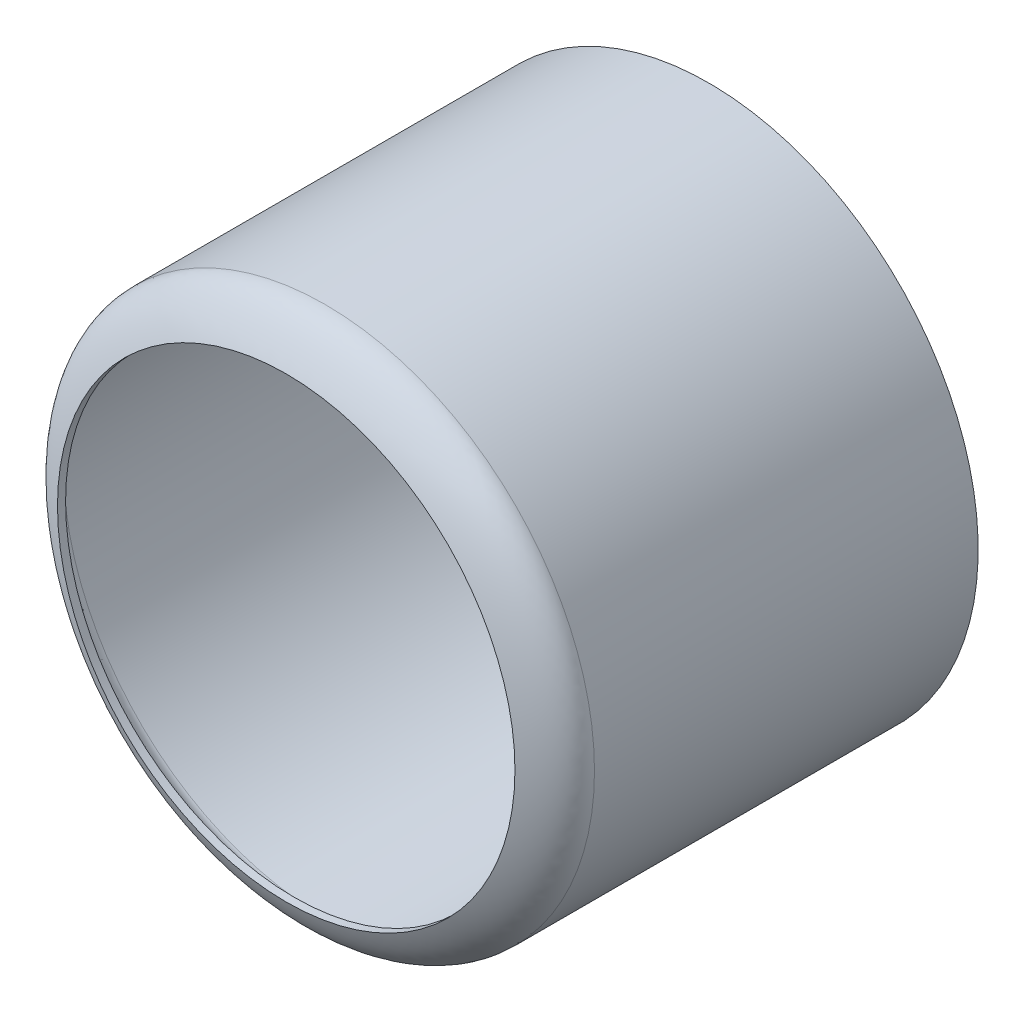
from build123d import *

# Parameters (mm, degrees)
SKETCH1_R         = 18.25
EXTRUDE1_DEPTH    = 26
DOME1_FACE_RADIUS = 18.25
DOME1_HEIGHT      = 5
SHELL1_T          = -0.5
SKETCH3_R         = 15.5
EXTRUDE2_DEPTH    = 41.337637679


with BuildPart() as part:
    # Sketch1 → Extrude1 (new body)
    with BuildSketch(Plane.XY):
        with Locations(Location((0, 0, 0), (0, 0, 180))):
            Circle(SKETCH1_R)
    extrude(amount=EXTRUDE1_DEPTH)

    # Dome1: an elliptical dome of height H over a round flat face of radius A is half a spheroid: the quarter ellipse of half axes A and H revolved about the face's axis
    with BuildSketch(Plane((0, 0, 26), x_dir=(0, 1, 0), z_dir=(1, 0, 0)), mode=Mode.PRIVATE) as dome1_quarter:
        Ellipse(DOME1_FACE_RADIUS, DOME1_HEIGHT)
        Rectangle(DOME1_FACE_RADIUS, DOME1_HEIGHT, align=(Align.MIN, Align.MIN), mode=Mode.INTERSECT)
    revolve(dome1_quarter.sketch, axis=Axis((0, 0, 26), (0, 0, 1)))

    # Shell1
    shell1_openings = [part.faces().sort_by_distance(p)[0] for p in [
        (0, 0, 0),
    ]]
    offset(amount=SHELL1_T, openings=shell1_openings, kind=Kind.INTERSECTION)

    # Sketch3 → Extrude2 (cut, through all)
    with BuildSketch(Plane(origin=(0, 0, 0), x_dir=(-1, 0, 0), z_dir=(0, 0, -1))):
        with Locations(Location((0, 0, 0), (0, 0, 180))):
            Circle(SKETCH3_R)
    extrude(amount=-EXTRUDE2_DEPTH, mode=Mode.SUBTRACT)


solid = part.part
